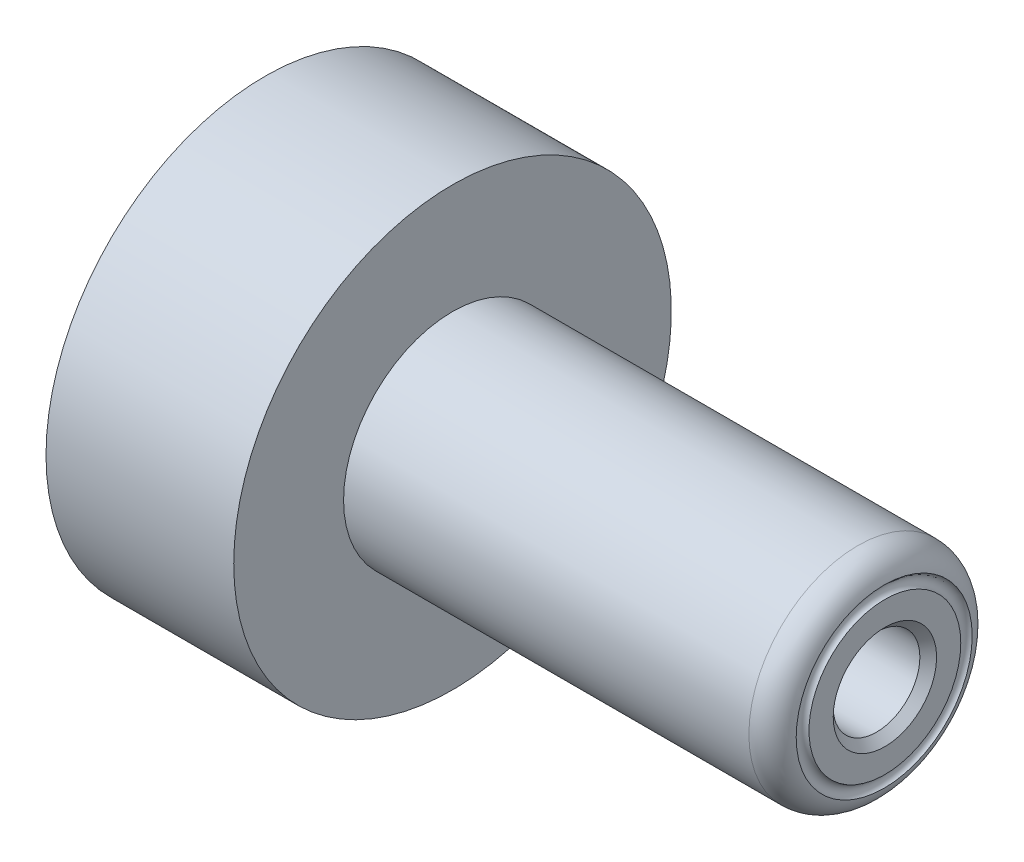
ISO-10303-21;
HEADER;
FILE_DESCRIPTION(('STEP AP214'),'2;1');
FILE_NAME('part.step','',(''),(''),'','','');
FILE_SCHEMA(('AUTOMOTIVE_DESIGN { 1 0 10303 214 1 1 1 1 }'));
ENDSEC;
DATA;
#1=APPLICATION_CONTEXT('core data for automotive mechanical design processes');
#2=APPLICATION_PROTOCOL_DEFINITION('international standard','automotive_design',2000,#1);
#3=PRODUCT_CONTEXT('',#1,'mechanical');
#4=PRODUCT('Part','Part','',(#3));
#5=PRODUCT_RELATED_PRODUCT_CATEGORY('part','',(#4));
#6=PRODUCT_DEFINITION_FORMATION('','',#4);
#7=PRODUCT_DEFINITION_CONTEXT('part definition',#1,'design');
#8=PRODUCT_DEFINITION('design','',#6,#7);
#9=PRODUCT_DEFINITION_SHAPE('','',#8);
#10=(LENGTH_UNIT() NAMED_UNIT(*) SI_UNIT(.MILLI.,.METRE.));
#11=(NAMED_UNIT(*) PLANE_ANGLE_UNIT() SI_UNIT($,.RADIAN.));
#12=(NAMED_UNIT(*) SI_UNIT($,.STERADIAN.) SOLID_ANGLE_UNIT());
#13=UNCERTAINTY_MEASURE_WITH_UNIT(LENGTH_MEASURE(1.E-05),#10,'distance_accuracy_value','');
#14=(GEOMETRIC_REPRESENTATION_CONTEXT(3) GLOBAL_UNCERTAINTY_ASSIGNED_CONTEXT((#13)) GLOBAL_UNIT_ASSIGNED_CONTEXT((#10,
#11,#12)) REPRESENTATION_CONTEXT('',''));
#15=CARTESIAN_POINT('',(0.,0.,0.));
#16=DIRECTION('',(0.,0.,1.));
#17=DIRECTION('',(1.,0.,0.));
#18=AXIS2_PLACEMENT_3D('',#15,#16,#17);
#19=CARTESIAN_POINT('',(35.9918,4.7546,0.));
#20=DIRECTION('',(-1.,0.,0.));
#21=DIRECTION('',(0.,0.,1.));
#22=AXIS2_PLACEMENT_3D('',#19,#20,#21);
#23=PLANE('',#22);
#24=CARTESIAN_POINT('',(35.9918,0.,0.));
#25=DIRECTION('',(-1.,0.,0.));
#26=DIRECTION('',(0.,0.,1.));
#27=AXIS2_PLACEMENT_3D('',#24,#25,#26);
#28=CIRCLE('',#27,3.);
#29=CARTESIAN_POINT('',(35.9918,0.,3.));
#30=VERTEX_POINT('',#29);
#31=EDGE_CURVE('E10',#30,#30,#28,.T.);
#32=ORIENTED_EDGE('',*,*,#31,.T.);
#33=EDGE_LOOP('',(#32));
#34=FACE_BOUND('',#33,.T.);
#35=CARTESIAN_POINT('',(35.9918,0.,0.));
#36=DIRECTION('',(1.,0.,0.));
#37=DIRECTION('',(0.,0.,-1.));
#38=AXIS2_PLACEMENT_3D('',#35,#36,#37);
#39=CIRCLE('',#38,4.40515842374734);
#40=CARTESIAN_POINT('',(35.9918,0.,-4.40515842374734));
#41=VERTEX_POINT('',#40);
#42=EDGE_CURVE('E78',#41,#41,#39,.F.);
#43=ORIENTED_EDGE('',*,*,#42,.F.);
#44=EDGE_LOOP('',(#43));
#45=FACE_BOUND('',#44,.T.);
#46=ADVANCED_FACE('F31',(#34,#45),#23,.F.);
#47=CARTESIAN_POINT('',(34.4218,0.,0.));
#48=DIRECTION('',(-1.,0.,0.));
#49=DIRECTION('',(0.,0.,1.));
#50=AXIS2_PLACEMENT_3D('',#47,#48,#49);
#51=TOROIDAL_SURFACE('',#50,4.7546,1.57);
#52=CARTESIAN_POINT('',(34.4218,0.,0.));
#53=DIRECTION('',(-1.,0.,0.));
#54=DIRECTION('',(0.,0.,1.));
#55=AXIS2_PLACEMENT_3D('',#52,#53,#54);
#56=CIRCLE('',#55,6.3246);
#57=CARTESIAN_POINT('',(34.4218,0.,6.3246));
#58=VERTEX_POINT('',#57);
#59=EDGE_CURVE('E48',#58,#58,#56,.T.);
#60=ORIENTED_EDGE('',*,*,#59,.F.);
#61=EDGE_LOOP('',(#60));
#62=FACE_BOUND('',#61,.T.);
#63=CARTESIAN_POINT('',(35.9514708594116,0.,0.));
#64=DIRECTION('',(1.,0.,0.));
#65=DIRECTION('',(0.,0.,-1.));
#66=AXIS2_PLACEMENT_3D('',#63,#64,#65);
#67=CIRCLE('',#66,5.10816337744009);
#68=CARTESIAN_POINT('',(35.9514708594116,0.,-5.10816337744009));
#69=VERTEX_POINT('',#68);
#70=EDGE_CURVE('E35',#69,#69,#67,.T.);
#71=ORIENTED_EDGE('',*,*,#70,.F.);
#72=EDGE_LOOP('',(#71));
#73=FACE_BOUND('',#72,.T.);
#74=ADVANCED_FACE('F87',(#62,#73),#51,.T.);
#75=CARTESIAN_POINT('',(0.,0.,0.));
#76=DIRECTION('',(-1.,0.,0.));
#77=DIRECTION('',(0.,0.,1.));
#78=AXIS2_PLACEMENT_3D('',#75,#76,#77);
#79=CYLINDRICAL_SURFACE('',#78,3.9751);
#80=CARTESIAN_POINT('',(21.8948,0.,0.));
#81=DIRECTION('',(-1.,0.,0.));
#82=DIRECTION('',(0.,0.,1.));
#83=AXIS2_PLACEMENT_3D('',#80,#81,#82);
#84=CIRCLE('',#83,3.9751);
#85=CARTESIAN_POINT('',(21.8948,0.,3.9751));
#86=VERTEX_POINT('',#85);
#87=EDGE_CURVE('E43',#86,#86,#84,.T.);
#88=ORIENTED_EDGE('',*,*,#87,.F.);
#89=EDGE_LOOP('',(#88));
#90=FACE_BOUND('',#89,.T.);
#91=CARTESIAN_POINT('',(0.,0.,0.));
#92=DIRECTION('',(-1.,0.,0.));
#93=DIRECTION('',(0.,0.,1.));
#94=AXIS2_PLACEMENT_3D('',#91,#92,#93);
#95=CIRCLE('',#94,3.9751);
#96=CARTESIAN_POINT('',(0.,0.,3.9751));
#97=VERTEX_POINT('',#96);
#98=EDGE_CURVE('E60',#97,#97,#95,.T.);
#99=ORIENTED_EDGE('',*,*,#98,.T.);
#100=EDGE_LOOP('',(#99));
#101=FACE_BOUND('',#100,.T.);
#102=ADVANCED_FACE('F89',(#90,#101),#79,.F.);
#103=CARTESIAN_POINT('',(21.8948,3.9751,0.));
#104=DIRECTION('',(1.,0.,0.));
#105=DIRECTION('',(0.,0.,-1.));
#106=AXIS2_PLACEMENT_3D('',#103,#104,#105);
#107=PLANE('',#106);
#108=CARTESIAN_POINT('',(21.8948,0.,0.));
#109=DIRECTION('',(1.,0.,0.));
#110=DIRECTION('',(0.,0.,-1.));
#111=AXIS2_PLACEMENT_3D('',#108,#109,#110);
#112=CIRCLE('',#111,2.515);
#113=CARTESIAN_POINT('',(21.8948,0.,-2.515));
#114=VERTEX_POINT('',#113);
#115=EDGE_CURVE('E73',#114,#114,#112,.T.);
#116=ORIENTED_EDGE('',*,*,#115,.T.);
#117=EDGE_LOOP('',(#116));
#118=FACE_BOUND('',#117,.T.);
#119=ORIENTED_EDGE('',*,*,#87,.T.);
#120=EDGE_LOOP('',(#119));
#121=FACE_BOUND('',#120,.T.);
#122=ADVANCED_FACE('F96',(#118,#121),#107,.F.);
#123=CARTESIAN_POINT('',(0.,0.,0.));
#124=DIRECTION('',(-1.,0.,0.));
#125=DIRECTION('',(0.,0.,1.));
#126=AXIS2_PLACEMENT_3D('',#123,#124,#125);
#127=CYLINDRICAL_SURFACE('',#126,6.3246);
#128=CARTESIAN_POINT('',(10.8966,0.,0.));
#129=DIRECTION('',(-1.,0.,0.));
#130=DIRECTION('',(0.,0.,1.));
#131=AXIS2_PLACEMENT_3D('',#128,#129,#130);
#132=CIRCLE('',#131,6.3246);
#133=CARTESIAN_POINT('',(10.8966,0.,6.3246));
#134=VERTEX_POINT('',#133);
#135=EDGE_CURVE('E51',#134,#134,#132,.T.);
#136=ORIENTED_EDGE('',*,*,#135,.F.);
#137=EDGE_LOOP('',(#136));
#138=FACE_BOUND('',#137,.T.);
#139=ORIENTED_EDGE('',*,*,#59,.T.);
#140=EDGE_LOOP('',(#139));
#141=FACE_BOUND('',#140,.T.);
#142=ADVANCED_FACE('F101',(#138,#141),#127,.T.);
#143=CARTESIAN_POINT('',(10.8966,12.7,0.));
#144=DIRECTION('',(-1.,0.,0.));
#145=DIRECTION('',(0.,0.,1.));
#146=AXIS2_PLACEMENT_3D('',#143,#144,#145);
#147=PLANE('',#146);
#148=CARTESIAN_POINT('',(10.8966,0.,0.));
#149=DIRECTION('',(-1.,0.,0.));
#150=DIRECTION('',(0.,0.,1.));
#151=AXIS2_PLACEMENT_3D('',#148,#149,#150);
#152=CIRCLE('',#151,12.7);
#153=CARTESIAN_POINT('',(10.8966,0.,12.7));
#154=VERTEX_POINT('',#153);
#155=EDGE_CURVE('E54',#154,#154,#152,.T.);
#156=ORIENTED_EDGE('',*,*,#155,.F.);
#157=EDGE_LOOP('',(#156));
#158=FACE_BOUND('',#157,.T.);
#159=ORIENTED_EDGE('',*,*,#135,.T.);
#160=EDGE_LOOP('',(#159));
#161=FACE_BOUND('',#160,.T.);
#162=ADVANCED_FACE('F109',(#158,#161),#147,.F.);
#163=CARTESIAN_POINT('',(0.,0.,0.));
#164=DIRECTION('',(-1.,0.,0.));
#165=DIRECTION('',(0.,0.,1.));
#166=AXIS2_PLACEMENT_3D('',#163,#164,#165);
#167=CYLINDRICAL_SURFACE('',#166,12.7);
#168=CARTESIAN_POINT('',(0.,0.,0.));
#169=DIRECTION('',(-1.,0.,0.));
#170=DIRECTION('',(0.,0.,1.));
#171=AXIS2_PLACEMENT_3D('',#168,#169,#170);
#172=CIRCLE('',#171,12.7);
#173=CARTESIAN_POINT('',(0.,0.,12.7));
#174=VERTEX_POINT('',#173);
#175=EDGE_CURVE('E57',#174,#174,#172,.T.);
#176=ORIENTED_EDGE('',*,*,#175,.F.);
#177=EDGE_LOOP('',(#176));
#178=FACE_BOUND('',#177,.T.);
#179=ORIENTED_EDGE('',*,*,#155,.T.);
#180=EDGE_LOOP('',(#179));
#181=FACE_BOUND('',#180,.T.);
#182=ADVANCED_FACE('F121',(#178,#181),#167,.T.);
#183=CARTESIAN_POINT('',(0.,3.9751,0.));
#184=DIRECTION('',(1.,0.,0.));
#185=DIRECTION('',(0.,0.,-1.));
#186=AXIS2_PLACEMENT_3D('',#183,#184,#185);
#187=PLANE('',#186);
#188=CARTESIAN_POINT('',(0.,0.,7.1374));
#189=DIRECTION('',(-1.,0.,0.));
#190=DIRECTION('',(0.,0.,-1.));
#191=AXIS2_PLACEMENT_3D('',#188,#189,#190);
#192=CIRCLE('',#191,1.6129);
#193=CARTESIAN_POINT('',(0.,0.,5.5245));
#194=VERTEX_POINT('',#193);
#195=EDGE_CURVE('E70',#194,#194,#192,.T.);
#196=ORIENTED_EDGE('',*,*,#195,.F.);
#197=EDGE_LOOP('',(#196));
#198=FACE_BOUND('',#197,.T.);
#199=CARTESIAN_POINT('',(0.,0.,-7.1374));
#200=DIRECTION('',(-1.,0.,0.));
#201=DIRECTION('',(0.,0.,1.));
#202=AXIS2_PLACEMENT_3D('',#199,#200,#201);
#203=CIRCLE('',#202,1.6129);
#204=CARTESIAN_POINT('',(0.,0.,-5.5245));
#205=VERTEX_POINT('',#204);
#206=EDGE_CURVE('E64',#205,#205,#203,.T.);
#207=ORIENTED_EDGE('',*,*,#206,.F.);
#208=EDGE_LOOP('',(#207));
#209=FACE_BOUND('',#208,.T.);
#210=ORIENTED_EDGE('',*,*,#98,.F.);
#211=EDGE_LOOP('',(#210));
#212=FACE_BOUND('',#211,.T.);
#213=ORIENTED_EDGE('',*,*,#175,.T.);
#214=EDGE_LOOP('',(#213));
#215=FACE_BOUND('',#214,.T.);
#216=ADVANCED_FACE('F117',(#198,#209,#212,#215),#187,.F.);
#217=CARTESIAN_POINT('',(6.35,0.,-7.1374));
#218=DIRECTION('',(-1.,0.,0.));
#219=DIRECTION('',(0.,0.,1.));
#220=AXIS2_PLACEMENT_3D('',#217,#218,#219);
#221=CYLINDRICAL_SURFACE('',#220,1.6129);
#222=CARTESIAN_POINT('',(6.35,0.,-7.1374));
#223=DIRECTION('',(-1.,0.,0.));
#224=DIRECTION('',(0.,0.,1.));
#225=AXIS2_PLACEMENT_3D('',#222,#223,#224);
#226=CIRCLE('',#225,1.6129);
#227=CARTESIAN_POINT('',(6.35,0.,-5.5245));
#228=VERTEX_POINT('',#227);
#229=EDGE_CURVE('E63',#228,#228,#226,.T.);
#230=ORIENTED_EDGE('',*,*,#229,.F.);
#231=EDGE_LOOP('',(#230));
#232=FACE_BOUND('',#231,.T.);
#233=ORIENTED_EDGE('',*,*,#206,.T.);
#234=EDGE_LOOP('',(#233));
#235=FACE_BOUND('',#234,.T.);
#236=ADVANCED_FACE('F120',(#232,#235),#221,.F.);
#237=CARTESIAN_POINT('',(6.35,0.,-7.1374));
#238=DIRECTION('',(-1.,0.,0.));
#239=DIRECTION('',(0.,0.,1.));
#240=AXIS2_PLACEMENT_3D('',#237,#238,#239);
#241=PLANE('',#240);
#242=ORIENTED_EDGE('',*,*,#229,.T.);
#243=EDGE_LOOP('',(#242));
#244=FACE_BOUND('',#243,.T.);
#245=ADVANCED_FACE('F140',(#244),#241,.T.);
#246=CARTESIAN_POINT('',(6.35,0.,7.1374));
#247=DIRECTION('',(-1.,0.,0.));
#248=DIRECTION('',(0.,0.,1.));
#249=AXIS2_PLACEMENT_3D('',#246,#247,#248);
#250=CYLINDRICAL_SURFACE('',#249,1.6129);
#251=CARTESIAN_POINT('',(6.35,0.,7.1374));
#252=DIRECTION('',(-1.,0.,0.));
#253=DIRECTION('',(0.,0.,-1.));
#254=AXIS2_PLACEMENT_3D('',#251,#252,#253);
#255=CIRCLE('',#254,1.6129);
#256=CARTESIAN_POINT('',(6.35,0.,5.5245));
#257=VERTEX_POINT('',#256);
#258=EDGE_CURVE('E67',#257,#257,#255,.T.);
#259=ORIENTED_EDGE('',*,*,#258,.F.);
#260=EDGE_LOOP('',(#259));
#261=FACE_BOUND('',#260,.T.);
#262=ORIENTED_EDGE('',*,*,#195,.T.);
#263=EDGE_LOOP('',(#262));
#264=FACE_BOUND('',#263,.T.);
#265=ADVANCED_FACE('F144',(#261,#264),#250,.F.);
#266=CARTESIAN_POINT('',(6.35,0.,7.1374));
#267=DIRECTION('',(1.,0.,0.));
#268=DIRECTION('',(0.,0.,-1.));
#269=AXIS2_PLACEMENT_3D('',#266,#267,#268);
#270=PLANE('',#269);
#271=ORIENTED_EDGE('',*,*,#258,.T.);
#272=EDGE_LOOP('',(#271));
#273=FACE_BOUND('',#272,.T.);
#274=ADVANCED_FACE('F148',(#273),#270,.F.);
#275=CARTESIAN_POINT('',(0.,0.,0.));
#276=DIRECTION('',(1.,0.,0.));
#277=DIRECTION('',(0.,0.,-1.));
#278=AXIS2_PLACEMENT_3D('',#275,#276,#277);
#279=CYLINDRICAL_SURFACE('',#278,2.515);
#280=CARTESIAN_POINT('',(35.5068,0.,0.));
#281=DIRECTION('',(-1.,0.,0.));
#282=DIRECTION('',(0.,0.,1.));
#283=AXIS2_PLACEMENT_3D('',#280,#281,#282);
#284=CIRCLE('',#283,2.515);
#285=CARTESIAN_POINT('',(35.5068,0.,2.515));
#286=VERTEX_POINT('',#285);
#287=EDGE_CURVE('E39',#286,#286,#284,.F.);
#288=ORIENTED_EDGE('',*,*,#287,.T.);
#289=EDGE_LOOP('',(#288));
#290=FACE_BOUND('',#289,.T.);
#291=ORIENTED_EDGE('',*,*,#115,.F.);
#292=EDGE_LOOP('',(#291));
#293=FACE_BOUND('',#292,.T.);
#294=ADVANCED_FACE('F152',(#290,#293),#279,.F.);
#295=CARTESIAN_POINT('',(35.5068,0.,0.));
#296=DIRECTION('',(1.,0.,0.));
#297=DIRECTION('',(0.,0.,-1.));
#298=AXIS2_PLACEMENT_3D('',#295,#296,#297);
#299=CONICAL_SURFACE('',#298,2.515,0.785398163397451);
#300=ORIENTED_EDGE('',*,*,#31,.F.);
#301=EDGE_LOOP('',(#300));
#302=FACE_BOUND('',#301,.T.);
#303=ORIENTED_EDGE('',*,*,#287,.F.);
#304=EDGE_LOOP('',(#303));
#305=FACE_BOUND('',#304,.T.);
#306=ADVANCED_FACE('F33',(#302,#305),#299,.F.);
#307=CARTESIAN_POINT('',(36.117,0.,0.));
#308=DIRECTION('',(-1.,0.,0.));
#309=DIRECTION('',(0.,0.,1.));
#310=AXIS2_PLACEMENT_3D('',#307,#308,#309);
#311=TOROIDAL_SURFACE('',#310,4.765,0.381000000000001);
#312=ORIENTED_EDGE('',*,*,#70,.T.);
#313=EDGE_LOOP('',(#312));
#314=FACE_BOUND('',#313,.T.);
#315=ORIENTED_EDGE('',*,*,#42,.T.);
#316=EDGE_LOOP('',(#315));
#317=FACE_BOUND('',#316,.T.);
#318=ADVANCED_FACE('F85',(#314,#317),#311,.F.);
#319=CLOSED_SHELL('',(#46,#74,#102,#122,#142,#162,#182,#216,#236,#245,#265,#274,#294,#306,#318));
#320=MANIFOLD_SOLID_BREP('B2',#319);
#321=ADVANCED_BREP_SHAPE_REPRESENTATION('',(#18,#320),#14);
#322=SHAPE_DEFINITION_REPRESENTATION(#9,#321);
ENDSEC;
END-ISO-10303-21;
